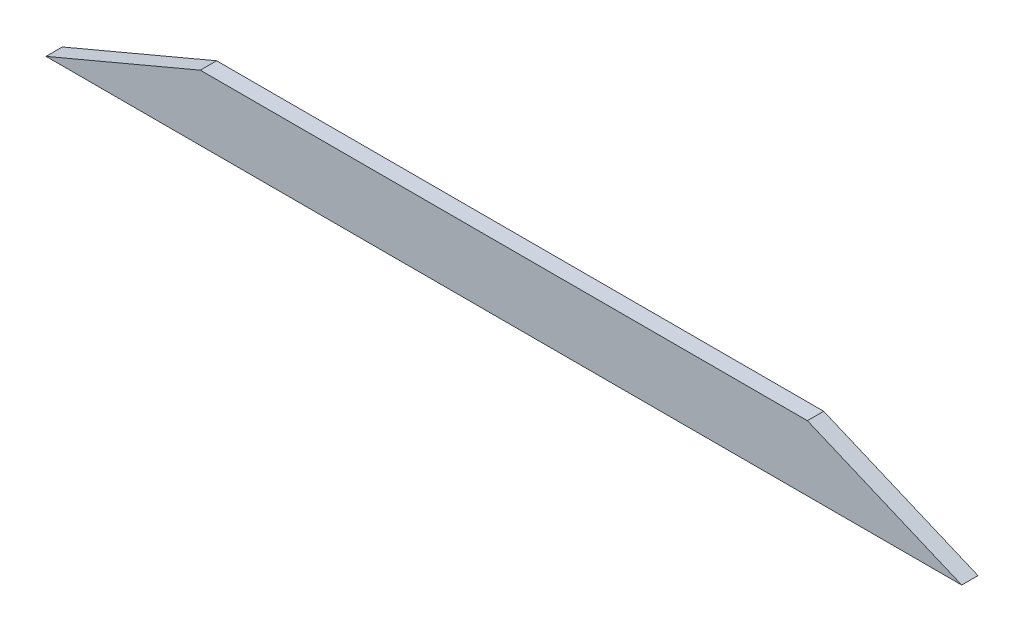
ISO-10303-21;
HEADER;
FILE_DESCRIPTION(('STEP AP214'),'2;1');
FILE_NAME('part.step','',(''),(''),'','','');
FILE_SCHEMA(('AUTOMOTIVE_DESIGN { 1 0 10303 214 1 1 1 1 }'));
ENDSEC;
DATA;
#1=APPLICATION_CONTEXT('core data for automotive mechanical design processes');
#2=APPLICATION_PROTOCOL_DEFINITION('international standard','automotive_design',2000,#1);
#3=PRODUCT_CONTEXT('',#1,'mechanical');
#4=PRODUCT('Part','Part','',(#3));
#5=PRODUCT_RELATED_PRODUCT_CATEGORY('part','',(#4));
#6=PRODUCT_DEFINITION_FORMATION('','',#4);
#7=PRODUCT_DEFINITION_CONTEXT('part definition',#1,'design');
#8=PRODUCT_DEFINITION('design','',#6,#7);
#9=PRODUCT_DEFINITION_SHAPE('','',#8);
#10=(LENGTH_UNIT() NAMED_UNIT(*) SI_UNIT(.MILLI.,.METRE.));
#11=(NAMED_UNIT(*) PLANE_ANGLE_UNIT() SI_UNIT($,.RADIAN.));
#12=(NAMED_UNIT(*) SI_UNIT($,.STERADIAN.) SOLID_ANGLE_UNIT());
#13=UNCERTAINTY_MEASURE_WITH_UNIT(LENGTH_MEASURE(1.E-05),#10,'distance_accuracy_value','');
#14=(GEOMETRIC_REPRESENTATION_CONTEXT(3) GLOBAL_UNCERTAINTY_ASSIGNED_CONTEXT((#13)) GLOBAL_UNIT_ASSIGNED_CONTEXT((#10,
#11,#12)) REPRESENTATION_CONTEXT('',''));
#15=CARTESIAN_POINT('',(0.,0.,0.));
#16=DIRECTION('',(0.,0.,1.));
#17=DIRECTION('',(1.,0.,0.));
#18=AXIS2_PLACEMENT_3D('',#15,#16,#17);
#19=CARTESIAN_POINT('',(-713.476237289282,-50.7999999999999,25.4));
#20=DIRECTION('',(0.389216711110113,-0.921146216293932,0.));
#21=DIRECTION('',(0.921146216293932,0.389216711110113,0.));
#22=AXIS2_PLACEMENT_3D('',#19,#20,#21);
#23=PLANE('',#22);
#24=DIRECTION('',(-0.921146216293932,-0.389216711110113,0.));
#25=VECTOR('',#24,1.);
#26=CARTESIAN_POINT('',(-713.476237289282,-50.7999999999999,0.));
#27=LINE('',#26,#25);
#28=CARTESIAN_POINT('',(-473.022903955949,50.8000000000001,0.));
#29=VERTEX_POINT('',#28);
#30=CARTESIAN_POINT('',(-713.476237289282,-50.7999999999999,0.));
#31=VERTEX_POINT('',#30);
#32=EDGE_CURVE('E107',#29,#31,#27,.T.);
#33=ORIENTED_EDGE('',*,*,#32,.T.);
#34=DIRECTION('',(0.,0.,-1.));
#35=VECTOR('',#34,1.);
#36=CARTESIAN_POINT('',(-713.476237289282,-50.7999999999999,25.4));
#37=LINE('',#36,#35);
#38=CARTESIAN_POINT('',(-713.476237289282,-50.7999999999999,25.4));
#39=VERTEX_POINT('',#38);
#40=EDGE_CURVE('E11',#39,#31,#37,.T.);
#41=ORIENTED_EDGE('',*,*,#40,.F.);
#42=DIRECTION('',(-0.921146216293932,-0.389216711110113,0.));
#43=VECTOR('',#42,1.);
#44=CARTESIAN_POINT('',(-713.476237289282,-50.7999999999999,25.4));
#45=LINE('',#44,#43);
#46=CARTESIAN_POINT('',(-473.022903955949,50.8000000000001,25.4));
#47=VERTEX_POINT('',#46);
#48=EDGE_CURVE('E91',#47,#39,#45,.T.);
#49=ORIENTED_EDGE('',*,*,#48,.F.);
#50=DIRECTION('',(0.,0.,-1.));
#51=VECTOR('',#50,1.);
#52=CARTESIAN_POINT('',(-473.022903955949,50.8000000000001,25.4));
#53=LINE('',#52,#51);
#54=EDGE_CURVE('E103',#47,#29,#53,.T.);
#55=ORIENTED_EDGE('',*,*,#54,.T.);
#56=EDGE_LOOP('',(#33,#41,#49,#55));
#57=FACE_BOUND('',#56,.T.);
#58=ADVANCED_FACE('F39',(#57),#23,.F.);
#59=CARTESIAN_POINT('',(-713.476237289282,-50.7999999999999,25.4));
#60=DIRECTION('',(0.,1.,0.));
#61=DIRECTION('',(-1.,0.,0.));
#62=AXIS2_PLACEMENT_3D('',#59,#60,#61);
#63=PLANE('',#62);
#64=DIRECTION('',(1.,0.,0.));
#65=VECTOR('',#64,1.);
#66=CARTESIAN_POINT('',(-713.476237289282,-50.7999999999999,0.));
#67=LINE('',#66,#65);
#68=CARTESIAN_POINT('',(713.47623728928,-50.7999999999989,0.));
#69=VERTEX_POINT('',#68);
#70=EDGE_CURVE('E96',#31,#69,#67,.T.);
#71=ORIENTED_EDGE('',*,*,#70,.T.);
#72=DIRECTION('',(0.,0.,-1.));
#73=VECTOR('',#72,1.);
#74=CARTESIAN_POINT('',(713.47623728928,-50.7999999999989,25.4));
#75=LINE('',#74,#73);
#76=CARTESIAN_POINT('',(713.47623728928,-50.7999999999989,25.4));
#77=VERTEX_POINT('',#76);
#78=EDGE_CURVE('E48',#77,#69,#75,.T.);
#79=ORIENTED_EDGE('',*,*,#78,.F.);
#80=DIRECTION('',(1.,0.,0.));
#81=VECTOR('',#80,1.);
#82=CARTESIAN_POINT('',(-713.476237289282,-50.7999999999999,25.4));
#83=LINE('',#82,#81);
#84=EDGE_CURVE('E86',#39,#77,#83,.T.);
#85=ORIENTED_EDGE('',*,*,#84,.F.);
#86=ORIENTED_EDGE('',*,*,#40,.T.);
#87=EDGE_LOOP('',(#71,#79,#85,#86));
#88=FACE_BOUND('',#87,.T.);
#89=ADVANCED_FACE('F95',(#88),#63,.F.);
#90=CARTESIAN_POINT('',(713.47623728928,-50.7999999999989,25.4));
#91=DIRECTION('',(-0.389216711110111,-0.921146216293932,0.));
#92=DIRECTION('',(0.921146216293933,-0.389216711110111,0.));
#93=AXIS2_PLACEMENT_3D('',#90,#91,#92);
#94=PLANE('',#93);
#95=DIRECTION('',(-0.921146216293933,0.389216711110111,0.));
#96=VECTOR('',#95,1.);
#97=CARTESIAN_POINT('',(713.47623728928,-50.7999999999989,0.));
#98=LINE('',#97,#96);
#99=CARTESIAN_POINT('',(473.022903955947,50.8000000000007,0.));
#100=VERTEX_POINT('',#99);
#101=EDGE_CURVE('E73',#69,#100,#98,.T.);
#102=ORIENTED_EDGE('',*,*,#101,.T.);
#103=DIRECTION('',(0.,0.,-1.));
#104=VECTOR('',#103,1.);
#105=CARTESIAN_POINT('',(473.022903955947,50.8000000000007,25.4));
#106=LINE('',#105,#104);
#107=CARTESIAN_POINT('',(473.022903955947,50.8000000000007,25.4));
#108=VERTEX_POINT('',#107);
#109=EDGE_CURVE('E98',#108,#100,#106,.T.);
#110=ORIENTED_EDGE('',*,*,#109,.F.);
#111=DIRECTION('',(-0.921146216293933,0.389216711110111,0.));
#112=VECTOR('',#111,1.);
#113=CARTESIAN_POINT('',(713.47623728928,-50.7999999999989,25.4));
#114=LINE('',#113,#112);
#115=EDGE_CURVE('E89',#77,#108,#114,.T.);
#116=ORIENTED_EDGE('',*,*,#115,.F.);
#117=ORIENTED_EDGE('',*,*,#78,.T.);
#118=EDGE_LOOP('',(#102,#110,#116,#117));
#119=FACE_BOUND('',#118,.T.);
#120=ADVANCED_FACE('F99',(#119),#94,.F.);
#121=CARTESIAN_POINT('',(-473.022903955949,50.8000000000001,25.4));
#122=DIRECTION('',(0.,-1.,0.));
#123=DIRECTION('',(1.,0.,0.));
#124=AXIS2_PLACEMENT_3D('',#121,#122,#123);
#125=PLANE('',#124);
#126=DIRECTION('',(-1.,0.,0.));
#127=VECTOR('',#126,1.);
#128=CARTESIAN_POINT('',(-473.022903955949,50.8000000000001,0.));
#129=LINE('',#128,#127);
#130=EDGE_CURVE('E79',#100,#29,#129,.T.);
#131=ORIENTED_EDGE('',*,*,#130,.T.);
#132=ORIENTED_EDGE('',*,*,#54,.F.);
#133=DIRECTION('',(-1.,0.,0.));
#134=VECTOR('',#133,1.);
#135=CARTESIAN_POINT('',(-473.022903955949,50.8000000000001,25.4));
#136=LINE('',#135,#134);
#137=EDGE_CURVE('E56',#108,#47,#136,.T.);
#138=ORIENTED_EDGE('',*,*,#137,.F.);
#139=ORIENTED_EDGE('',*,*,#109,.T.);
#140=EDGE_LOOP('',(#131,#132,#138,#139));
#141=FACE_BOUND('',#140,.T.);
#142=ADVANCED_FACE('F120',(#141),#125,.F.);
#143=CARTESIAN_POINT('',(0.,0.,25.4));
#144=DIRECTION('',(0.,0.,1.));
#145=DIRECTION('',(1.,0.,0.));
#146=AXIS2_PLACEMENT_3D('',#143,#144,#145);
#147=PLANE('',#146);
#148=ORIENTED_EDGE('',*,*,#48,.T.);
#149=ORIENTED_EDGE('',*,*,#84,.T.);
#150=ORIENTED_EDGE('',*,*,#115,.T.);
#151=ORIENTED_EDGE('',*,*,#137,.T.);
#152=EDGE_LOOP('',(#148,#149,#150,#151));
#153=FACE_BOUND('',#152,.T.);
#154=ADVANCED_FACE('F87',(#153),#147,.T.);
#155=CARTESIAN_POINT('',(0.,0.,0.));
#156=DIRECTION('',(0.,0.,1.));
#157=DIRECTION('',(1.,0.,0.));
#158=AXIS2_PLACEMENT_3D('',#155,#156,#157);
#159=PLANE('',#158);
#160=ORIENTED_EDGE('',*,*,#32,.F.);
#161=ORIENTED_EDGE('',*,*,#130,.F.);
#162=ORIENTED_EDGE('',*,*,#101,.F.);
#163=ORIENTED_EDGE('',*,*,#70,.F.);
#164=EDGE_LOOP('',(#160,#161,#162,#163));
#165=FACE_BOUND('',#164,.T.);
#166=ADVANCED_FACE('F123',(#165),#159,.F.);
#167=CLOSED_SHELL('',(#58,#89,#120,#142,#154,#166));
#168=MANIFOLD_SOLID_BREP('B2',#167);
#169=ADVANCED_BREP_SHAPE_REPRESENTATION('',(#18,#168),#14);
#170=SHAPE_DEFINITION_REPRESENTATION(#9,#169);
ENDSEC;
END-ISO-10303-21;
